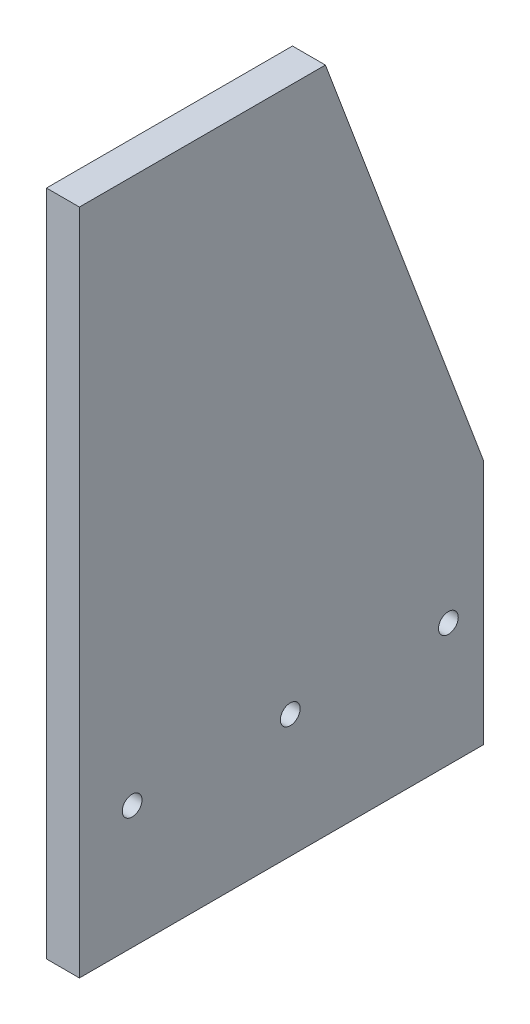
from build123d import *

# Parameters (mm, degrees)
SKETCH1_R           = 3.571875
BOSS_EXTRUDE1_DEPTH = 11.90625


with BuildPart() as part:
    # Sketch1 → Boss-Extrude1 (new body)
    with BuildSketch(Plane(origin=(0, 0, 0), x_dir=(0, 0, -1), z_dir=(1, 0, 0))):
        Polygon((0, 0), (0, 241.3), (88.9, 241.3), (146.05, 88.9), (146.05, 0), align=None)
        with Locations((19.05, 44.45)):
            Circle(SKETCH1_R, mode=Mode.SUBTRACT)
        with Locations((76.2, 44.45)):
            Circle(SKETCH1_R, mode=Mode.SUBTRACT)
        with Locations((133.35, 44.45)):
            Circle(SKETCH1_R, mode=Mode.SUBTRACT)
    extrude(amount=BOSS_EXTRUDE1_DEPTH)


solid = part.part
